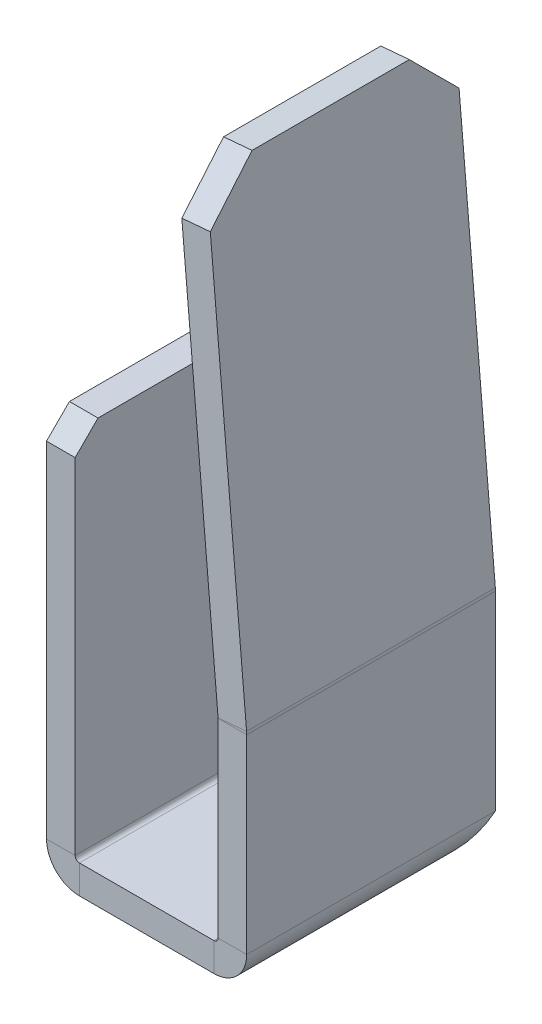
ISO-10303-21;
HEADER;
FILE_DESCRIPTION(('STEP AP214'),'2;1');
FILE_NAME('part.step','',(''),(''),'','','');
FILE_SCHEMA(('AUTOMOTIVE_DESIGN { 1 0 10303 214 1 1 1 1 }'));
ENDSEC;
DATA;
#1=APPLICATION_CONTEXT('core data for automotive mechanical design processes');
#2=APPLICATION_PROTOCOL_DEFINITION('international standard','automotive_design',2000,#1);
#3=PRODUCT_CONTEXT('',#1,'mechanical');
#4=PRODUCT('Part','Part','',(#3));
#5=PRODUCT_RELATED_PRODUCT_CATEGORY('part','',(#4));
#6=PRODUCT_DEFINITION_FORMATION('','',#4);
#7=PRODUCT_DEFINITION_CONTEXT('part definition',#1,'design');
#8=PRODUCT_DEFINITION('design','',#6,#7);
#9=PRODUCT_DEFINITION_SHAPE('','',#8);
#10=(LENGTH_UNIT() NAMED_UNIT(*) SI_UNIT(.MILLI.,.METRE.));
#11=(NAMED_UNIT(*) PLANE_ANGLE_UNIT() SI_UNIT($,.RADIAN.));
#12=(NAMED_UNIT(*) SI_UNIT($,.STERADIAN.) SOLID_ANGLE_UNIT());
#13=UNCERTAINTY_MEASURE_WITH_UNIT(LENGTH_MEASURE(1.E-05),#10,'distance_accuracy_value','');
#14=(GEOMETRIC_REPRESENTATION_CONTEXT(3) GLOBAL_UNCERTAINTY_ASSIGNED_CONTEXT((#13)) GLOBAL_UNIT_ASSIGNED_CONTEXT((#10,
#11,#12)) REPRESENTATION_CONTEXT('',''));
#15=CARTESIAN_POINT('',(0.,0.,0.));
#16=DIRECTION('',(0.,0.,1.));
#17=DIRECTION('',(1.,0.,0.));
#18=AXIS2_PLACEMENT_3D('',#15,#16,#17);
#19=CARTESIAN_POINT('',(35.,-1.56345456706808E-13,0.));
#20=DIRECTION('',(-1.,0.,0.));
#21=DIRECTION('',(0.,-1.,0.));
#22=AXIS2_PLACEMENT_3D('',#19,#20,#21);
#23=PLANE('',#22);
#24=DIRECTION('',(0.,1.,0.));
#25=VECTOR('',#24,1.);
#26=CARTESIAN_POINT('',(35.,-1.56345456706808E-13,-54.5));
#27=LINE('',#26,#25);
#28=CARTESIAN_POINT('',(35.,1.49999999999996,-54.5));
#29=VERTEX_POINT('',#28);
#30=CARTESIAN_POINT('',(35.0000000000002,68.0536504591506,-54.5));
#31=VERTEX_POINT('',#30);
#32=EDGE_CURVE('E389',#29,#31,#27,.T.);
#33=ORIENTED_EDGE('',*,*,#32,.T.);
#34=DIRECTION('',(0.,0.,1.));
#35=VECTOR('',#34,1.);
#36=CARTESIAN_POINT('',(35.0000000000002,68.0536504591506,0.));
#37=LINE('',#36,#35);
#38=CARTESIAN_POINT('',(35.0000000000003,68.0536504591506,32.5));
#39=VERTEX_POINT('',#38);
#40=EDGE_CURVE('E257',#31,#39,#37,.T.);
#41=ORIENTED_EDGE('',*,*,#40,.T.);
#42=DIRECTION('',(0.,-1.,0.));
#43=VECTOR('',#42,1.);
#44=CARTESIAN_POINT('',(35.,-1.56345456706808E-13,32.5));
#45=LINE('',#44,#43);
#46=CARTESIAN_POINT('',(35.,1.49999999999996,32.5));
#47=VERTEX_POINT('',#46);
#48=EDGE_CURVE('E391',#39,#47,#45,.T.);
#49=ORIENTED_EDGE('',*,*,#48,.T.);
#50=DIRECTION('',(0.,0.,-1.));
#51=VECTOR('',#50,1.);
#52=CARTESIAN_POINT('',(35.,1.49999999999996,32.5));
#53=LINE('',#52,#51);
#54=EDGE_CURVE('E270',#29,#47,#53,.F.);
#55=ORIENTED_EDGE('',*,*,#54,.F.);
#56=EDGE_LOOP('',(#33,#41,#49,#55));
#57=FACE_BOUND('',#56,.T.);
#58=ADVANCED_FACE('F84',(#57),#23,.F.);
#59=CARTESIAN_POINT('',(35.0000000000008,230.,-54.5));
#60=DIRECTION('',(0.,0.,1.));
#61=DIRECTION('',(1.,0.,0.));
#62=AXIS2_PLACEMENT_3D('',#59,#60,#61);
#63=PLANE('',#62);
#64=DIRECTION('',(0.,-1.,0.));
#65=VECTOR('',#64,1.);
#66=CARTESIAN_POINT('',(25.0000000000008,230.,-54.5));
#67=LINE('',#66,#65);
#68=CARTESIAN_POINT('',(24.9999999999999,1.49999999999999,-54.5));
#69=VERTEX_POINT('',#68);
#70=CARTESIAN_POINT('',(25.0000000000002,68.0536504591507,-54.5));
#71=VERTEX_POINT('',#70);
#72=EDGE_CURVE('E393',#69,#71,#67,.F.);
#73=ORIENTED_EDGE('',*,*,#72,.T.);
#74=DIRECTION('',(1.,0.,0.));
#75=VECTOR('',#74,1.);
#76=CARTESIAN_POINT('',(35.0000000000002,68.0536504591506,-54.5));
#77=LINE('',#76,#75);
#78=EDGE_CURVE('E401',#71,#31,#77,.T.);
#79=ORIENTED_EDGE('',*,*,#78,.T.);
#80=ORIENTED_EDGE('',*,*,#32,.F.);
#81=DIRECTION('',(-1.,0.,0.));
#82=VECTOR('',#81,1.);
#83=CARTESIAN_POINT('',(25.,1.49999999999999,-54.5));
#84=LINE('',#83,#82);
#85=EDGE_CURVE('E274',#69,#29,#84,.F.);
#86=ORIENTED_EDGE('',*,*,#85,.F.);
#87=EDGE_LOOP('',(#73,#79,#80,#86));
#88=FACE_BOUND('',#87,.T.);
#89=ADVANCED_FACE('F344',(#88),#63,.F.);
#90=CARTESIAN_POINT('',(35.,0.,32.5));
#91=DIRECTION('',(0.,0.,-1.));
#92=DIRECTION('',(-1.,0.,0.));
#93=AXIS2_PLACEMENT_3D('',#90,#91,#92);
#94=PLANE('',#93);
#95=ORIENTED_EDGE('',*,*,#48,.F.);
#96=DIRECTION('',(-1.,0.,0.));
#97=VECTOR('',#96,1.);
#98=CARTESIAN_POINT('',(35.0000000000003,68.0536504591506,32.5));
#99=LINE('',#98,#97);
#100=CARTESIAN_POINT('',(25.0000000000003,68.0536504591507,32.5));
#101=VERTEX_POINT('',#100);
#102=EDGE_CURVE('E388',#39,#101,#99,.T.);
#103=ORIENTED_EDGE('',*,*,#102,.T.);
#104=DIRECTION('',(0.,1.,0.));
#105=VECTOR('',#104,1.);
#106=CARTESIAN_POINT('',(25.,0.,32.5));
#107=LINE('',#106,#105);
#108=CARTESIAN_POINT('',(25.,1.49999999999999,32.5));
#109=VERTEX_POINT('',#108);
#110=EDGE_CURVE('E273',#101,#109,#107,.F.);
#111=ORIENTED_EDGE('',*,*,#110,.T.);
#112=DIRECTION('',(-1.,0.,0.));
#113=VECTOR('',#112,1.);
#114=CARTESIAN_POINT('',(35.,1.49999999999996,32.5));
#115=LINE('',#114,#113);
#116=EDGE_CURVE('E262',#109,#47,#115,.F.);
#117=ORIENTED_EDGE('',*,*,#116,.T.);
#118=EDGE_LOOP('',(#95,#103,#111,#117));
#119=FACE_BOUND('',#118,.T.);
#120=ADVANCED_FACE('F350',(#119),#94,.F.);
#121=CARTESIAN_POINT('',(0.,-10.,0.));
#122=DIRECTION('',(0.,1.,0.));
#123=DIRECTION('',(0.,0.,1.));
#124=AXIS2_PLACEMENT_3D('',#121,#122,#123);
#125=PLANE('',#124);
#126=DIRECTION('',(0.,0.,-1.));
#127=VECTOR('',#126,1.);
#128=CARTESIAN_POINT('',(23.5000000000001,-9.99999999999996,-54.5));
#129=LINE('',#128,#127);
#130=CARTESIAN_POINT('',(23.5000000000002,-9.99999999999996,-32.5));
#131=VERTEX_POINT('',#130);
#132=CARTESIAN_POINT('',(23.5000000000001,-10.,32.5));
#133=VERTEX_POINT('',#132);
#134=EDGE_CURVE('E285',#131,#133,#129,.F.);
#135=ORIENTED_EDGE('',*,*,#134,.T.);
#136=DIRECTION('',(1.,0.,0.));
#137=VECTOR('',#136,1.);
#138=CARTESIAN_POINT('',(-35.,-10.,32.5));
#139=LINE('',#138,#137);
#140=CARTESIAN_POINT('',(-23.5,-10.,32.5));
#141=VERTEX_POINT('',#140);
#142=EDGE_CURVE('E460',#141,#133,#139,.T.);
#143=ORIENTED_EDGE('',*,*,#142,.F.);
#144=DIRECTION('',(0.,0.,1.));
#145=VECTOR('',#144,1.);
#146=CARTESIAN_POINT('',(-23.5,-10.,32.5));
#147=LINE('',#146,#145);
#148=CARTESIAN_POINT('',(-23.5,-10.,-32.5));
#149=VERTEX_POINT('',#148);
#150=EDGE_CURVE('E298',#141,#149,#147,.F.);
#151=ORIENTED_EDGE('',*,*,#150,.T.);
#152=DIRECTION('',(-1.,0.,0.));
#153=VECTOR('',#152,1.);
#154=CARTESIAN_POINT('',(-35.,-10.,-32.5));
#155=LINE('',#154,#153);
#156=EDGE_CURVE('E464',#131,#149,#155,.T.);
#157=ORIENTED_EDGE('',*,*,#156,.F.);
#158=EDGE_LOOP('',(#135,#143,#151,#157));
#159=FACE_BOUND('',#158,.T.);
#160=ADVANCED_FACE('F354',(#159),#125,.F.);
#161=CARTESIAN_POINT('',(0.,0.,0.));
#162=DIRECTION('',(0.,1.,0.));
#163=DIRECTION('',(0.,0.,1.));
#164=AXIS2_PLACEMENT_3D('',#161,#162,#163);
#165=PLANE('',#164);
#166=DIRECTION('',(1.,0.,0.));
#167=VECTOR('',#166,1.);
#168=CARTESIAN_POINT('',(-35.,0.,32.5));
#169=LINE('',#168,#167);
#170=CARTESIAN_POINT('',(-23.5,0.,32.5));
#171=VERTEX_POINT('',#170);
#172=CARTESIAN_POINT('',(23.5000000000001,0.,32.5));
#173=VERTEX_POINT('',#172);
#174=EDGE_CURVE('E446',#171,#173,#169,.T.);
#175=ORIENTED_EDGE('',*,*,#174,.T.);
#176=DIRECTION('',(0.,0.,-1.));
#177=VECTOR('',#176,1.);
#178=CARTESIAN_POINT('',(23.5,0.,-54.5));
#179=LINE('',#178,#177);
#180=CARTESIAN_POINT('',(23.5,0.,-32.5));
#181=VERTEX_POINT('',#180);
#182=EDGE_CURVE('E290',#181,#173,#179,.F.);
#183=ORIENTED_EDGE('',*,*,#182,.F.);
#184=DIRECTION('',(-1.,0.,0.));
#185=VECTOR('',#184,1.);
#186=CARTESIAN_POINT('',(-35.,0.,-32.5));
#187=LINE('',#186,#185);
#188=CARTESIAN_POINT('',(-23.5,0.,-32.5));
#189=VERTEX_POINT('',#188);
#190=EDGE_CURVE('E466',#181,#189,#187,.T.);
#191=ORIENTED_EDGE('',*,*,#190,.T.);
#192=DIRECTION('',(0.,0.,1.));
#193=VECTOR('',#192,1.);
#194=CARTESIAN_POINT('',(-23.5,0.,32.5));
#195=LINE('',#194,#193);
#196=EDGE_CURVE('E433',#171,#189,#195,.F.);
#197=ORIENTED_EDGE('',*,*,#196,.F.);
#198=EDGE_LOOP('',(#175,#183,#191,#197));
#199=FACE_BOUND('',#198,.T.);
#200=ADVANCED_FACE('F529',(#199),#165,.T.);
#201=CARTESIAN_POINT('',(-35.,-10.,-32.5));
#202=DIRECTION('',(0.,0.,-1.));
#203=DIRECTION('',(-1.,0.,0.));
#204=AXIS2_PLACEMENT_3D('',#201,#202,#203);
#205=PLANE('',#204);
#206=DIRECTION('',(0.,-1.,0.));
#207=VECTOR('',#206,1.);
#208=CARTESIAN_POINT('',(-23.5,0.,-32.5));
#209=LINE('',#208,#207);
#210=EDGE_CURVE('E449',#189,#149,#209,.T.);
#211=ORIENTED_EDGE('',*,*,#210,.F.);
#212=ORIENTED_EDGE('',*,*,#190,.F.);
#213=DIRECTION('',(0.,-1.,0.));
#214=VECTOR('',#213,1.);
#215=CARTESIAN_POINT('',(23.5,0.,-32.5));
#216=LINE('',#215,#214);
#217=EDGE_CURVE('E284',#181,#131,#216,.T.);
#218=ORIENTED_EDGE('',*,*,#217,.T.);
#219=ORIENTED_EDGE('',*,*,#156,.T.);
#220=EDGE_LOOP('',(#211,#212,#218,#219));
#221=FACE_BOUND('',#220,.T.);
#222=ADVANCED_FACE('F522',(#221),#205,.T.);
#223=CARTESIAN_POINT('',(-35.,-10.,32.5));
#224=DIRECTION('',(0.,0.,1.));
#225=DIRECTION('',(1.,0.,0.));
#226=AXIS2_PLACEMENT_3D('',#223,#224,#225);
#227=PLANE('',#226);
#228=DIRECTION('',(0.,-1.,0.));
#229=VECTOR('',#228,1.);
#230=CARTESIAN_POINT('',(23.5000000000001,0.,32.5));
#231=LINE('',#230,#229);
#232=EDGE_CURVE('E295',#173,#133,#231,.T.);
#233=ORIENTED_EDGE('',*,*,#232,.F.);
#234=ORIENTED_EDGE('',*,*,#174,.F.);
#235=DIRECTION('',(0.,-1.,0.));
#236=VECTOR('',#235,1.);
#237=CARTESIAN_POINT('',(-23.5,0.,32.5));
#238=LINE('',#237,#236);
#239=EDGE_CURVE('E461',#171,#141,#238,.T.);
#240=ORIENTED_EDGE('',*,*,#239,.T.);
#241=ORIENTED_EDGE('',*,*,#142,.T.);
#242=EDGE_LOOP('',(#233,#234,#240,#241));
#243=FACE_BOUND('',#242,.T.);
#244=ADVANCED_FACE('F531',(#243),#227,.T.);
#245=CARTESIAN_POINT('',(-23.5,1.5,-32.5));
#246=DIRECTION('',(0.,0.,-1.));
#247=DIRECTION('',(0.,1.,0.));
#248=AXIS2_PLACEMENT_3D('',#245,#246,#247);
#249=PLANE('',#248);
#250=DIRECTION('',(1.,0.,0.));
#251=VECTOR('',#250,1.);
#252=CARTESIAN_POINT('',(-35.,1.49999999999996,-32.5));
#253=LINE('',#252,#251);
#254=CARTESIAN_POINT('',(-25.,1.5,-32.5));
#255=VERTEX_POINT('',#254);
#256=CARTESIAN_POINT('',(-35.,1.49999999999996,-32.5));
#257=VERTEX_POINT('',#256);
#258=EDGE_CURVE('E413',#255,#257,#253,.F.);
#259=ORIENTED_EDGE('',*,*,#258,.F.);
#260=CARTESIAN_POINT('',(-23.5,1.5,-32.5));
#261=DIRECTION('',(0.,0.,1.));
#262=DIRECTION('',(0.,-1.,0.));
#263=AXIS2_PLACEMENT_3D('',#260,#261,#262);
#264=CIRCLE('',#263,1.5);
#265=EDGE_CURVE('E441',#189,#255,#264,.F.);
#266=ORIENTED_EDGE('',*,*,#265,.F.);
#267=ORIENTED_EDGE('',*,*,#210,.T.);
#268=CARTESIAN_POINT('',(-23.5,1.5,-32.5));
#269=DIRECTION('',(0.,0.,1.));
#270=DIRECTION('',(0.,-1.,0.));
#271=AXIS2_PLACEMENT_3D('',#268,#269,#270);
#272=CIRCLE('',#271,11.5);
#273=EDGE_CURVE('E438',#149,#257,#272,.F.);
#274=ORIENTED_EDGE('',*,*,#273,.T.);
#275=EDGE_LOOP('',(#259,#266,#267,#274));
#276=FACE_BOUND('',#275,.T.);
#277=ADVANCED_FACE('F517',(#276),#249,.T.);
#278=CARTESIAN_POINT('',(-23.5,1.49999999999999,32.5));
#279=DIRECTION('',(0.,0.,-1.));
#280=DIRECTION('',(0.,1.,0.));
#281=AXIS2_PLACEMENT_3D('',#278,#279,#280);
#282=PLANE('',#281);
#283=CARTESIAN_POINT('',(-23.5,1.49999999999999,32.5));
#284=DIRECTION('',(0.,0.,1.));
#285=DIRECTION('',(0.,-1.,0.));
#286=AXIS2_PLACEMENT_3D('',#283,#284,#285);
#287=CIRCLE('',#286,1.5);
#288=CARTESIAN_POINT('',(-25.,1.49999999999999,32.5));
#289=VERTEX_POINT('',#288);
#290=EDGE_CURVE('E429',#289,#171,#287,.T.);
#291=ORIENTED_EDGE('',*,*,#290,.F.);
#292=DIRECTION('',(1.,0.,0.));
#293=VECTOR('',#292,1.);
#294=CARTESIAN_POINT('',(-25.,1.49999999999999,32.5));
#295=LINE('',#294,#293);
#296=CARTESIAN_POINT('',(-35.,1.49999999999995,32.5));
#297=VERTEX_POINT('',#296);
#298=EDGE_CURVE('E435',#289,#297,#295,.F.);
#299=ORIENTED_EDGE('',*,*,#298,.T.);
#300=CARTESIAN_POINT('',(-23.5,1.49999999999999,32.5));
#301=DIRECTION('',(0.,0.,1.));
#302=DIRECTION('',(0.,-1.,0.));
#303=AXIS2_PLACEMENT_3D('',#300,#301,#302);
#304=CIRCLE('',#303,11.5);
#305=EDGE_CURVE('E434',#297,#141,#304,.T.);
#306=ORIENTED_EDGE('',*,*,#305,.T.);
#307=ORIENTED_EDGE('',*,*,#239,.F.);
#308=EDGE_LOOP('',(#291,#299,#306,#307));
#309=FACE_BOUND('',#308,.T.);
#310=ADVANCED_FACE('F510',(#309),#282,.F.);
#311=CARTESIAN_POINT('',(-23.5,1.49999999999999,32.5));
#312=DIRECTION('',(0.,0.,1.));
#313=DIRECTION('',(-1.,0.,0.));
#314=AXIS2_PLACEMENT_3D('',#311,#312,#313);
#315=CYLINDRICAL_SURFACE('',#314,11.5);
#316=ORIENTED_EDGE('',*,*,#150,.F.);
#317=ORIENTED_EDGE('',*,*,#305,.F.);
#318=DIRECTION('',(0.,0.,1.));
#319=VECTOR('',#318,1.);
#320=CARTESIAN_POINT('',(-35.,1.49999999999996,-32.5));
#321=LINE('',#320,#319);
#322=EDGE_CURVE('E430',#297,#257,#321,.F.);
#323=ORIENTED_EDGE('',*,*,#322,.T.);
#324=ORIENTED_EDGE('',*,*,#273,.F.);
#325=EDGE_LOOP('',(#316,#317,#323,#324));
#326=FACE_BOUND('',#325,.T.);
#327=ADVANCED_FACE('F515',(#326),#315,.T.);
#328=CARTESIAN_POINT('',(-23.5,1.49999999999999,32.5));
#329=DIRECTION('',(0.,0.,1.));
#330=DIRECTION('',(-1.,0.,0.));
#331=AXIS2_PLACEMENT_3D('',#328,#329,#330);
#332=CYLINDRICAL_SURFACE('',#331,1.5);
#333=ORIENTED_EDGE('',*,*,#196,.T.);
#334=ORIENTED_EDGE('',*,*,#265,.T.);
#335=DIRECTION('',(0.,0.,1.));
#336=VECTOR('',#335,1.);
#337=CARTESIAN_POINT('',(-25.,1.49999999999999,-32.5));
#338=LINE('',#337,#336);
#339=EDGE_CURVE('E439',#255,#289,#338,.T.);
#340=ORIENTED_EDGE('',*,*,#339,.T.);
#341=ORIENTED_EDGE('',*,*,#290,.T.);
#342=EDGE_LOOP('',(#333,#334,#340,#341));
#343=FACE_BOUND('',#342,.T.);
#344=ADVANCED_FACE('F526',(#343),#332,.F.);
#345=CARTESIAN_POINT('',(-35.0000000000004,130.,32.5));
#346=DIRECTION('',(0.,0.,-1.));
#347=DIRECTION('',(-1.,0.,0.));
#348=AXIS2_PLACEMENT_3D('',#345,#346,#347);
#349=PLANE('',#348);
#350=DIRECTION('',(0.,-1.,0.));
#351=VECTOR('',#350,1.);
#352=CARTESIAN_POINT('',(-25.0000000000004,130.,32.5));
#353=LINE('',#352,#351);
#354=CARTESIAN_POINT('',(-25.0000000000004,122.,32.5));
#355=VERTEX_POINT('',#354);
#356=EDGE_CURVE('E425',#289,#355,#353,.F.);
#357=ORIENTED_EDGE('',*,*,#356,.T.);
#358=DIRECTION('',(-1.,0.,0.));
#359=VECTOR('',#358,1.);
#360=CARTESIAN_POINT('',(-35.0000000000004,122.,32.5));
#361=LINE('',#360,#359);
#362=CARTESIAN_POINT('',(-35.0000000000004,122.,32.5));
#363=VERTEX_POINT('',#362);
#364=EDGE_CURVE('E428',#355,#363,#361,.T.);
#365=ORIENTED_EDGE('',*,*,#364,.T.);
#366=DIRECTION('',(0.,1.,0.));
#367=VECTOR('',#366,1.);
#368=CARTESIAN_POINT('',(-35.,-1.56345456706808E-13,32.5));
#369=LINE('',#368,#367);
#370=EDGE_CURVE('E408',#297,#363,#369,.T.);
#371=ORIENTED_EDGE('',*,*,#370,.F.);
#372=ORIENTED_EDGE('',*,*,#298,.F.);
#373=EDGE_LOOP('',(#357,#365,#371,#372));
#374=FACE_BOUND('',#373,.T.);
#375=ADVANCED_FACE('F506',(#374),#349,.F.);
#376=CARTESIAN_POINT('',(-35.,0.,-32.5));
#377=DIRECTION('',(0.,0.,1.));
#378=DIRECTION('',(1.,0.,0.));
#379=AXIS2_PLACEMENT_3D('',#376,#377,#378);
#380=PLANE('',#379);
#381=DIRECTION('',(0.,-1.,0.));
#382=VECTOR('',#381,1.);
#383=CARTESIAN_POINT('',(-35.,-1.56345456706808E-13,-32.5));
#384=LINE('',#383,#382);
#385=CARTESIAN_POINT('',(-35.0000000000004,122.,-32.5));
#386=VERTEX_POINT('',#385);
#387=EDGE_CURVE('E406',#386,#257,#384,.T.);
#388=ORIENTED_EDGE('',*,*,#387,.F.);
#389=DIRECTION('',(1.,0.,0.));
#390=VECTOR('',#389,1.);
#391=CARTESIAN_POINT('',(-35.0000000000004,122.,-32.5));
#392=LINE('',#391,#390);
#393=CARTESIAN_POINT('',(-25.0000000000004,122.,-32.5));
#394=VERTEX_POINT('',#393);
#395=EDGE_CURVE('E419',#386,#394,#392,.T.);
#396=ORIENTED_EDGE('',*,*,#395,.T.);
#397=DIRECTION('',(0.,1.,0.));
#398=VECTOR('',#397,1.);
#399=CARTESIAN_POINT('',(-25.,0.,-32.5));
#400=LINE('',#399,#398);
#401=EDGE_CURVE('E417',#394,#255,#400,.F.);
#402=ORIENTED_EDGE('',*,*,#401,.T.);
#403=ORIENTED_EDGE('',*,*,#258,.T.);
#404=EDGE_LOOP('',(#388,#396,#402,#403));
#405=FACE_BOUND('',#404,.T.);
#406=ADVANCED_FACE('F490',(#405),#380,.F.);
#407=CARTESIAN_POINT('',(-35.,-1.56345456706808E-13,0.));
#408=DIRECTION('',(1.,0.,0.));
#409=DIRECTION('',(0.,1.,0.));
#410=AXIS2_PLACEMENT_3D('',#407,#408,#409);
#411=PLANE('',#410);
#412=DIRECTION('',(0.,0.,-1.));
#413=VECTOR('',#412,1.);
#414=CARTESIAN_POINT('',(-35.0000000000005,130.,0.));
#415=LINE('',#414,#413);
#416=CARTESIAN_POINT('',(-35.0000000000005,130.,24.5));
#417=VERTEX_POINT('',#416);
#418=CARTESIAN_POINT('',(-35.0000000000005,130.,-24.5));
#419=VERTEX_POINT('',#418);
#420=EDGE_CURVE('E410',#417,#419,#415,.T.);
#421=ORIENTED_EDGE('',*,*,#420,.T.);
#422=DIRECTION('',(0.,0.707106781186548,0.707106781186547));
#423=VECTOR('',#422,1.);
#424=CARTESIAN_POINT('',(-35.0000000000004,122.,-32.5));
#425=LINE('',#424,#423);
#426=EDGE_CURVE('E409',#419,#386,#425,.F.);
#427=ORIENTED_EDGE('',*,*,#426,.T.);
#428=ORIENTED_EDGE('',*,*,#387,.T.);
#429=ORIENTED_EDGE('',*,*,#322,.F.);
#430=ORIENTED_EDGE('',*,*,#370,.T.);
#431=DIRECTION('',(0.,-0.707106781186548,0.707106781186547));
#432=VECTOR('',#431,1.);
#433=CARTESIAN_POINT('',(-35.0000000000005,130.,24.5));
#434=LINE('',#433,#432);
#435=EDGE_CURVE('E416',#363,#417,#434,.F.);
#436=ORIENTED_EDGE('',*,*,#435,.T.);
#437=EDGE_LOOP('',(#421,#427,#428,#429,#430,#436));
#438=FACE_BOUND('',#437,.T.);
#439=ADVANCED_FACE('F484',(#438),#411,.F.);
#440=CARTESIAN_POINT('',(-25.,-1.21430643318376E-13,0.));
#441=DIRECTION('',(1.,0.,0.));
#442=DIRECTION('',(0.,1.,0.));
#443=AXIS2_PLACEMENT_3D('',#440,#441,#442);
#444=PLANE('',#443);
#445=ORIENTED_EDGE('',*,*,#401,.F.);
#446=DIRECTION('',(0.,-0.707106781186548,-0.707106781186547));
#447=VECTOR('',#446,1.);
#448=CARTESIAN_POINT('',(-25.0000000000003,77.2499999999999,-77.2500000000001));
#449=LINE('',#448,#447);
#450=CARTESIAN_POINT('',(-25.0000000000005,130.,-24.5));
#451=VERTEX_POINT('',#450);
#452=EDGE_CURVE('E475',#394,#451,#449,.F.);
#453=ORIENTED_EDGE('',*,*,#452,.T.);
#454=DIRECTION('',(0.,0.,1.));
#455=VECTOR('',#454,1.);
#456=CARTESIAN_POINT('',(-25.0000000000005,130.,-32.5));
#457=LINE('',#456,#455);
#458=CARTESIAN_POINT('',(-25.0000000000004,130.,24.5));
#459=VERTEX_POINT('',#458);
#460=EDGE_CURVE('E420',#459,#451,#457,.F.);
#461=ORIENTED_EDGE('',*,*,#460,.F.);
#462=DIRECTION('',(0.,0.707106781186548,-0.707106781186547));
#463=VECTOR('',#462,1.);
#464=CARTESIAN_POINT('',(-25.0000000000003,77.2499999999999,77.2500000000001));
#465=LINE('',#464,#463);
#466=EDGE_CURVE('E424',#459,#355,#465,.F.);
#467=ORIENTED_EDGE('',*,*,#466,.T.);
#468=ORIENTED_EDGE('',*,*,#356,.F.);
#469=ORIENTED_EDGE('',*,*,#339,.F.);
#470=EDGE_LOOP('',(#445,#453,#461,#467,#468,#469));
#471=FACE_BOUND('',#470,.T.);
#472=ADVANCED_FACE('F495',(#471),#444,.T.);
#473=CARTESIAN_POINT('',(-35.0000000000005,130.,-32.5));
#474=DIRECTION('',(0.,-1.,0.));
#475=DIRECTION('',(1.,0.,0.));
#476=AXIS2_PLACEMENT_3D('',#473,#474,#475);
#477=PLANE('',#476);
#478=ORIENTED_EDGE('',*,*,#460,.T.);
#479=DIRECTION('',(-1.,0.,0.));
#480=VECTOR('',#479,1.);
#481=CARTESIAN_POINT('',(-35.0000000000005,130.,-24.5));
#482=LINE('',#481,#480);
#483=EDGE_CURVE('E423',#451,#419,#482,.T.);
#484=ORIENTED_EDGE('',*,*,#483,.T.);
#485=ORIENTED_EDGE('',*,*,#420,.F.);
#486=DIRECTION('',(1.,0.,0.));
#487=VECTOR('',#486,1.);
#488=CARTESIAN_POINT('',(-35.0000000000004,130.,24.5));
#489=LINE('',#488,#487);
#490=EDGE_CURVE('E405',#417,#459,#489,.T.);
#491=ORIENTED_EDGE('',*,*,#490,.T.);
#492=EDGE_LOOP('',(#478,#484,#485,#491));
#493=FACE_BOUND('',#492,.T.);
#494=ADVANCED_FACE('F498',(#493),#477,.F.);
#495=CARTESIAN_POINT('',(-35.0000000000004,130.,24.5));
#496=DIRECTION('',(0.,-0.707106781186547,-0.707106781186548));
#497=DIRECTION('',(1.,0.,0.));
#498=AXIS2_PLACEMENT_3D('',#495,#496,#497);
#499=PLANE('',#498);
#500=ORIENTED_EDGE('',*,*,#435,.F.);
#501=ORIENTED_EDGE('',*,*,#364,.F.);
#502=ORIENTED_EDGE('',*,*,#466,.F.);
#503=ORIENTED_EDGE('',*,*,#490,.F.);
#504=EDGE_LOOP('',(#500,#501,#502,#503));
#505=FACE_BOUND('',#504,.T.);
#506=ADVANCED_FACE('F340',(#505),#499,.F.);
#507=CARTESIAN_POINT('',(-35.0000000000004,122.,-32.5));
#508=DIRECTION('',(0.,-0.707106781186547,0.707106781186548));
#509=DIRECTION('',(1.,0.,0.));
#510=AXIS2_PLACEMENT_3D('',#507,#508,#509);
#511=PLANE('',#510);
#512=ORIENTED_EDGE('',*,*,#426,.F.);
#513=ORIENTED_EDGE('',*,*,#483,.F.);
#514=ORIENTED_EDGE('',*,*,#452,.F.);
#515=ORIENTED_EDGE('',*,*,#395,.F.);
#516=EDGE_LOOP('',(#512,#513,#514,#515));
#517=FACE_BOUND('',#516,.T.);
#518=ADVANCED_FACE('F333',(#517),#511,.F.);
#519=CARTESIAN_POINT('',(23.5000000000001,1.5,32.5));
#520=DIRECTION('',(0.,0.,1.));
#521=DIRECTION('',(1.,0.,0.));
#522=AXIS2_PLACEMENT_3D('',#519,#520,#521);
#523=PLANE('',#522);
#524=ORIENTED_EDGE('',*,*,#116,.F.);
#525=CARTESIAN_POINT('',(23.5000000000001,1.5,32.5));
#526=DIRECTION('',(0.,0.,-1.));
#527=DIRECTION('',(-1.,0.,0.));
#528=AXIS2_PLACEMENT_3D('',#525,#526,#527);
#529=CIRCLE('',#528,1.49999999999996);
#530=EDGE_CURVE('E286',#173,#109,#529,.F.);
#531=ORIENTED_EDGE('',*,*,#530,.F.);
#532=ORIENTED_EDGE('',*,*,#232,.T.);
#533=CARTESIAN_POINT('',(23.5000000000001,1.5,32.5));
#534=DIRECTION('',(0.,0.,-1.));
#535=DIRECTION('',(-1.,0.,0.));
#536=AXIS2_PLACEMENT_3D('',#533,#534,#535);
#537=CIRCLE('',#536,11.5);
#538=EDGE_CURVE('E281',#133,#47,#537,.F.);
#539=ORIENTED_EDGE('',*,*,#538,.T.);
#540=EDGE_LOOP('',(#524,#531,#532,#539));
#541=FACE_BOUND('',#540,.T.);
#542=ADVANCED_FACE('F331',(#541),#523,.T.);
#543=CARTESIAN_POINT('',(35.0999999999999,1.49999999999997,-54.5));
#544=CARTESIAN_POINT('',(35.0999999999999,-0.0185468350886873,-52.6665322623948));
#545=CARTESIAN_POINT('',(34.7980830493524,-1.53627545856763,-50.8333333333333));
#546=CARTESIAN_POINT('',(33.6359221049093,-4.34198017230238,-47.1666666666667));
#547=CARTESIAN_POINT('',(32.7761353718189,-5.62874195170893,-45.3333333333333));
#548=CARTESIAN_POINT('',(30.628741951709,-7.7761353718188,-41.6666666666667));
#549=CARTESIAN_POINT('',(29.3419801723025,-8.63592210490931,-39.8333333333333));
#550=CARTESIAN_POINT('',(26.5362754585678,-9.79808304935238,-36.1666666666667));
#551=CARTESIAN_POINT('',(25.0185468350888,-10.0999999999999,-34.3334677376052));
#552=CARTESIAN_POINT('',(23.5000000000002,-10.1,-32.5));
#553=CARTESIAN_POINT('',(34.9999999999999,1.49999999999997,-54.5));
#554=CARTESIAN_POINT('',(34.9999999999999,-0.00545577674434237,-52.6665335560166));
#555=CARTESIAN_POINT('',(34.7006857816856,-1.51010067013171,-50.8333333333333));
#556=CARTESIAN_POINT('',(33.5485434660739,-4.29161827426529,-47.1666666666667));
#557=CARTESIAN_POINT('',(32.696168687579,-5.56728727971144,-45.3333333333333));
#558=CARTESIAN_POINT('',(30.5672872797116,-7.69616868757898,-41.6666666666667));
#559=CARTESIAN_POINT('',(29.2916182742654,-8.54854346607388,-39.8333333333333));
#560=CARTESIAN_POINT('',(26.5101006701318,-9.70068578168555,-36.1666666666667));
#561=CARTESIAN_POINT('',(25.0054557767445,-9.99999999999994,-34.3334664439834));
#562=CARTESIAN_POINT('',(23.5000000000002,-9.99999999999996,-32.5));
#563=CARTESIAN_POINT('',(24.9999999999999,1.5,-54.5));
#564=CARTESIAN_POINT('',(24.9999999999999,1.30365005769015,-52.6666629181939));
#565=CARTESIAN_POINT('',(24.9609590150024,1.10737817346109,-50.8333333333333));
#566=CARTESIAN_POINT('',(24.8106795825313,0.744571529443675,-47.1666666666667));
#567=CARTESIAN_POINT('',(24.6995002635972,0.578179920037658,-45.3333333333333));
#568=CARTESIAN_POINT('',(24.4218200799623,0.300499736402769,-41.6666666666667));
#569=CARTESIAN_POINT('',(24.2554284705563,0.189320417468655,-39.8333333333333));
#570=CARTESIAN_POINT('',(23.8926218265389,0.0390409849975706,-36.1666666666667));
#571=CARTESIAN_POINT('',(23.6963499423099,0.,-34.3333370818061));
#572=CARTESIAN_POINT('',(23.5,0.,-32.5));
#573=CARTESIAN_POINT('',(24.8989999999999,1.5,-54.5));
#574=CARTESIAN_POINT('',(24.8989999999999,1.31687202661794,-52.6666642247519));
#575=CARTESIAN_POINT('',(24.8625877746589,1.13381470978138,-50.8333333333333));
#576=CARTESIAN_POINT('',(24.7224271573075,0.795437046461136,-47.1666666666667));
#577=CARTESIAN_POINT('',(24.618733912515,0.640249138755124,-45.3333333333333));
#578=CARTESIAN_POINT('',(24.3597508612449,0.381266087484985,-41.6666666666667));
#579=CARTESIAN_POINT('',(24.2045629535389,0.277572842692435,-39.8333333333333));
#580=CARTESIAN_POINT('',(23.8661852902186,0.13741222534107,-36.1666666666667));
#581=CARTESIAN_POINT('',(23.6831279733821,0.101000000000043,-34.3333357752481));
#582=CARTESIAN_POINT('',(23.5,0.10100000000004,-32.5));
#583=B_SPLINE_SURFACE_WITH_KNOTS('',1,3,((#543,#544,#545,#546,#547,#548,#549,#550,#551,#552),
(#553,#554,#555,#556,#557,#558,#559,#560,#561,#562),(#563,#564,#565,#566,#567,#568,#569,#570,
#571,#572),(#573,#574,#575,#576,#577,#578,#579,#580,#581,#582)),.UNSPECIFIED.,.F.,.F.,.F.,(2,1,
1,2),(4,2,2,2,4),(-0.01,0.,1.,1.0101),(0.,0.25,0.5,0.75,1.),.UNSPECIFIED.);
#584=CARTESIAN_POINT('',(24.9999999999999,1.5,-54.5));
#585=CARTESIAN_POINT('',(25.0000090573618,1.44675543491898,-54.0028051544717));
#586=CARTESIAN_POINT('',(24.9971640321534,1.39350728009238,-53.5056152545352));
#587=CARTESIAN_POINT('',(24.9858399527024,1.28760837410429,-52.5112197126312));
#588=CARTESIAN_POINT('',(24.9773607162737,1.23495764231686,-52.0140140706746));
#589=CARTESIAN_POINT('',(24.9435783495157,1.07879137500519,-50.5221699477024));
#590=CARTESIAN_POINT('',(24.9099306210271,0.977085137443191,-49.5275176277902));
#591=CARTESIAN_POINT('',(24.8218830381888,0.783078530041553,-47.5382088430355));
#592=CARTESIAN_POINT('',(24.7674828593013,0.690778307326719,-46.5435523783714));
#593=CARTESIAN_POINT('',(24.634555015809,0.511915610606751,-44.462762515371));
#594=CARTESIAN_POINT('',(24.5542686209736,0.42666134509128,-43.3766284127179));
#595=CARTESIAN_POINT('',(24.376184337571,0.276960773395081,-41.2043412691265));
#596=CARTESIAN_POINT('',(24.278386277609,0.212514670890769,-40.1181882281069));
#597=CARTESIAN_POINT('',(24.1224223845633,0.133982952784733,-38.487723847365));
#598=CARTESIAN_POINT('',(24.068822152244,0.110812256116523,-37.9433956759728));
#599=CARTESIAN_POINT('',(23.9592896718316,0.0708573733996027,-36.8547360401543));
#600=CARTESIAN_POINT('',(23.9033574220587,0.0540731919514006,-36.310404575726));
#601=CARTESIAN_POINT('',(23.7899138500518,0.0271299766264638,-35.2217284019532));
#602=CARTESIAN_POINT('',(23.7324024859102,0.0169711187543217,-34.677383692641));
#603=CARTESIAN_POINT('',(23.6165932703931,0.00339770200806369,-33.5886929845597));
#604=CARTESIAN_POINT('',(23.5582954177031,-1.68455924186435E-05,-33.0443469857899));
#605=CARTESIAN_POINT('',(23.5,0.,-32.5));
#606=B_SPLINE_CURVE_WITH_KNOTS('',3,(#584,#585,#586,#587,#588,#589,#590,#591,#592,#593,#594,
#595,#596,#597,#598,#599,#600,#601,#602,#603,#604,#605),.UNSPECIFIED.,.F.,.F.,(4,2,2,2,2,2,2,2,
2,2,4),(0.,1.50009605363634,3.00024061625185,6.0011734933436,9.00215330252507,12.2791052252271,
15.5560892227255,17.1984085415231,18.8407290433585,20.4830931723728,22.1254600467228),.UNSPECIFIED.);
#607=EDGE_CURVE('E294',#69,#181,#606,.T.);
#608=CARTESIAN_POINT('',(34.9999999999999,1.49999999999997,-54.5));
#609=CARTESIAN_POINT('',(35.0000131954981,1.24447999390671,-54.1887993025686));
#610=CARTESIAN_POINT('',(34.9914843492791,0.988962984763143,-53.8775973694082));
#611=CARTESIAN_POINT('',(34.9574399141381,0.479085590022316,-53.255228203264));
#612=CARTESIAN_POINT('',(34.9319260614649,0.224725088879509,-52.9440609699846));
#613=CARTESIAN_POINT('',(34.8640109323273,-0.281726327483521,-52.3217532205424));
#614=CARTESIAN_POINT('',(34.8216106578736,-0.533817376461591,-52.0106127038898));
#615=CARTESIAN_POINT('',(34.7201164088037,-1.03461133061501,-51.3883366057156));
#616=CARTESIAN_POINT('',(34.6610227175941,-1.28331429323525,-51.0772010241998));
#617=CARTESIAN_POINT('',(34.5266394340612,-1.77536947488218,-50.4559968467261));
#618=CARTESIAN_POINT('',(34.45140655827,-2.01873722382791,-50.1459282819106));
#619=CARTESIAN_POINT('',(34.2849576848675,-2.49993749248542,-49.5257988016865));
#620=CARTESIAN_POINT('',(34.1937420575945,-2.73777014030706,-49.215737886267));
#621=CARTESIAN_POINT('',(33.9957300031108,-3.20685247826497,-48.5956171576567));
#622=CARTESIAN_POINT('',(33.8889338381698,-3.43810227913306,-48.2855573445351));
#623=CARTESIAN_POINT('',(33.6602333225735,-3.89300264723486,-47.6654526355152));
#624=CARTESIAN_POINT('',(33.5383291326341,-4.11665329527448,-47.3554077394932));
#625=CARTESIAN_POINT('',(33.2359376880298,-4.63008520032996,-46.629735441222));
#626=CARTESIAN_POINT('',(33.0496357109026,-4.91645660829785,-46.2141004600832));
#627=CARTESIAN_POINT('',(32.6523118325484,-5.47149163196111,-45.3828155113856));
#628=CARTESIAN_POINT('',(32.4412889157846,-5.74015451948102,-44.9671655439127));
#629=CARTESIAN_POINT('',(31.9961902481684,-6.25765600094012,-44.1358481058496));
#630=CARTESIAN_POINT('',(31.7621140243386,-6.50649418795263,-43.7201806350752));
#631=CARTESIAN_POINT('',(31.2727972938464,-6.98233897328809,-42.8888971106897));
#632=CARTESIAN_POINT('',(31.0175595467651,-7.20934840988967,-42.4732810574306));
#633=CARTESIAN_POINT('',(30.4879071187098,-7.63978145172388,-41.6420764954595));
#634=CARTESIAN_POINT('',(30.2134928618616,-7.84320557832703,-41.2264879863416));
#635=CARTESIAN_POINT('',(29.647671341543,-8.22484244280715,-40.3953278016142));
#636=CARTESIAN_POINT('',(29.3562652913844,-8.40305697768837,-39.979756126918));
#637=CARTESIAN_POINT('',(28.8462751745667,-8.68457700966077,-39.2703009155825));
#638=CARTESIAN_POINT('',(28.631346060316,-8.79453888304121,-38.9764079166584));
#639=CARTESIAN_POINT('',(28.1949934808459,-9.00072623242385,-38.3886247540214));
#640=CARTESIAN_POINT('',(27.9735701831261,-9.09695206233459,-38.0947345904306));
#641=CARTESIAN_POINT('',(27.5251164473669,-9.27528052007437,-37.5069552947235));
#642=CARTESIAN_POINT('',(27.298086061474,-9.35738327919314,-37.2130661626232));
#643=CARTESIAN_POINT('',(26.8393017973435,-9.50714723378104,-36.6252907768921));
#644=CARTESIAN_POINT('',(26.6075478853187,-9.57480832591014,-36.3314045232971));
#645=CARTESIAN_POINT('',(26.1395319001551,-9.69559971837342,-35.7427538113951));
#646=CARTESIAN_POINT('',(25.9032583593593,-9.74868567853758,-35.447989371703));
#647=CARTESIAN_POINT('',(25.4278276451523,-9.83984446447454,-34.8584525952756));
#648=CARTESIAN_POINT('',(25.1886704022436,-9.87791692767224,-34.5636802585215));
#649=CARTESIAN_POINT('',(24.708422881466,-9.93889377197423,-33.9741075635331));
#650=CARTESIAN_POINT('',(24.4673324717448,-9.9617971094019,-33.6793072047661));
#651=CARTESIAN_POINT('',(23.9841625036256,-9.99235637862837,-33.0896706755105));
#652=CARTESIAN_POINT('',(23.7420828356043,-10.0000105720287,-32.7948345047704));
#653=CARTESIAN_POINT('',(23.5000000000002,-9.99999999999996,-32.5));
#654=B_SPLINE_CURVE_WITH_KNOTS('',3,(#608,#609,#610,#611,#612,#613,#614,#615,#616,#617,#618,
#619,#620,#621,#622,#623,#624,#625,#626,#627,#628,#629,#630,#631,#632,#633,#634,#635,#636,#637,
#638,#639,#640,#641,#642,#643,#644,#645,#646,#647,#648,#649,#650,#651,#652,#653),.UNSPECIFIED.,
.F.,.F.,(4,2,2,2,2,2,2,2,2,2,2,2,2,2,2,2,2,2,2,2,2,2,4),(0.,1.20789310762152,2.41566276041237,
3.62336075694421,4.83103825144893,6.03453927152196,7.23801240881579,8.44146529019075,
9.64490537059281,11.2580778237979,12.871316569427,14.4845884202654,16.0976502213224,
17.7106763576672,19.3235874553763,20.4643296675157,21.6050424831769,22.7457446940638,
23.8864550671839,25.0305981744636,26.1747689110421,27.3190183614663,28.4633982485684),.UNSPECIFIED.);
#655=EDGE_CURVE('E289',#29,#131,#654,.T.);
#656=ORIENTED_EDGE('',*,*,#607,.F.);
#657=ORIENTED_EDGE('',*,*,#85,.T.);
#658=ORIENTED_EDGE('',*,*,#655,.T.);
#659=ORIENTED_EDGE('',*,*,#217,.F.);
#660=EDGE_LOOP('',(#656,#657,#658,#659));
#661=FACE_BOUND('',#660,.T.);
#662=ADVANCED_FACE('F314',(#661),#583,.F.);
#663=CARTESIAN_POINT('',(23.5,1.5,-54.5));
#664=DIRECTION('',(0.,0.,-1.));
#665=DIRECTION('',(1.,0.,0.));
#666=AXIS2_PLACEMENT_3D('',#663,#664,#665);
#667=CYLINDRICAL_SURFACE('',#666,11.5);
#668=ORIENTED_EDGE('',*,*,#134,.F.);
#669=ORIENTED_EDGE('',*,*,#655,.F.);
#670=ORIENTED_EDGE('',*,*,#54,.T.);
#671=ORIENTED_EDGE('',*,*,#538,.F.);
#672=EDGE_LOOP('',(#668,#669,#670,#671));
#673=FACE_BOUND('',#672,.T.);
#674=ADVANCED_FACE('F320',(#673),#667,.T.);
#675=CARTESIAN_POINT('',(23.5,1.5,-54.5));
#676=DIRECTION('',(0.,0.,-1.));
#677=DIRECTION('',(1.,0.,0.));
#678=AXIS2_PLACEMENT_3D('',#675,#676,#677);
#679=CYLINDRICAL_SURFACE('',#678,1.49999999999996);
#680=ORIENTED_EDGE('',*,*,#182,.T.);
#681=ORIENTED_EDGE('',*,*,#530,.T.);
#682=DIRECTION('',(0.,0.,-1.));
#683=VECTOR('',#682,1.);
#684=CARTESIAN_POINT('',(25.,1.49999999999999,32.5));
#685=LINE('',#684,#683);
#686=EDGE_CURVE('E277',#109,#69,#685,.T.);
#687=ORIENTED_EDGE('',*,*,#686,.T.);
#688=ORIENTED_EDGE('',*,*,#607,.T.);
#689=EDGE_LOOP('',(#680,#681,#687,#688));
#690=FACE_BOUND('',#689,.T.);
#691=ADVANCED_FACE('F324',(#690),#679,.F.);
#692=CARTESIAN_POINT('',(25.,-1.21430643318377E-13,0.));
#693=DIRECTION('',(-1.,0.,0.));
#694=DIRECTION('',(0.,-1.,0.));
#695=AXIS2_PLACEMENT_3D('',#692,#693,#694);
#696=PLANE('',#695);
#697=DIRECTION('',(0.,0.,1.));
#698=VECTOR('',#697,1.);
#699=CARTESIAN_POINT('',(25.0000000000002,68.0536504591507,0.));
#700=LINE('',#699,#698);
#701=EDGE_CURVE('E399',#71,#101,#700,.T.);
#702=ORIENTED_EDGE('',*,*,#701,.F.);
#703=ORIENTED_EDGE('',*,*,#72,.F.);
#704=ORIENTED_EDGE('',*,*,#686,.F.);
#705=ORIENTED_EDGE('',*,*,#110,.F.);
#706=EDGE_LOOP('',(#702,#703,#704,#705));
#707=FACE_BOUND('',#706,.T.);
#708=ADVANCED_FACE('F329',(#707),#696,.T.);
#709=CARTESIAN_POINT('',(23.5000000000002,68.0536504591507,-54.5));
#710=DIRECTION('',(0.,0.,-1.));
#711=DIRECTION('',(-1.,0.,0.));
#712=AXIS2_PLACEMENT_3D('',#709,#710,#711);
#713=PLANE('',#712);
#714=ORIENTED_EDGE('',*,*,#78,.F.);
#715=CARTESIAN_POINT('',(23.5000000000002,68.0536504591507,-54.5));
#716=DIRECTION('',(0.,0.,1.));
#717=DIRECTION('',(1.,0.,0.));
#718=AXIS2_PLACEMENT_3D('',#715,#716,#717);
#719=CIRCLE('',#718,1.5);
#720=CARTESIAN_POINT('',(24.9942920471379,68.1843840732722,-54.5));
#721=VERTEX_POINT('',#720);
#722=EDGE_CURVE('E253',#71,#721,#719,.T.);
#723=ORIENTED_EDGE('',*,*,#722,.T.);
#724=DIRECTION('',(0.996194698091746,0.0871557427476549,0.));
#725=VECTOR('',#724,1.);
#726=CARTESIAN_POINT('',(34.9562390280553,69.0559415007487,-54.5));
#727=LINE('',#726,#725);
#728=CARTESIAN_POINT('',(34.9562390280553,69.0559415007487,-54.5));
#729=VERTEX_POINT('',#728);
#730=EDGE_CURVE('E240',#721,#729,#727,.T.);
#731=ORIENTED_EDGE('',*,*,#730,.T.);
#732=CARTESIAN_POINT('',(23.5000000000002,68.0536504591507,-54.5));
#733=DIRECTION('',(0.,0.,1.));
#734=DIRECTION('',(1.,0.,0.));
#735=AXIS2_PLACEMENT_3D('',#732,#733,#734);
#736=CIRCLE('',#735,11.5);
#737=EDGE_CURVE('E250',#31,#729,#736,.T.);
#738=ORIENTED_EDGE('',*,*,#737,.F.);
#739=EDGE_LOOP('',(#714,#723,#731,#738));
#740=FACE_BOUND('',#739,.T.);
#741=ADVANCED_FACE('F249',(#740),#713,.T.);
#742=CARTESIAN_POINT('',(23.5000000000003,68.0536504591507,32.5));
#743=DIRECTION('',(0.,0.,1.));
#744=DIRECTION('',(1.,0.,0.));
#745=AXIS2_PLACEMENT_3D('',#742,#743,#744);
#746=PLANE('',#745);
#747=DIRECTION('',(-0.996194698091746,-0.0871557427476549,0.));
#748=VECTOR('',#747,1.);
#749=CARTESIAN_POINT('',(34.9562390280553,69.0559415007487,32.5));
#750=LINE('',#749,#748);
#751=CARTESIAN_POINT('',(34.9562390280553,69.0559415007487,32.5));
#752=VERTEX_POINT('',#751);
#753=CARTESIAN_POINT('',(24.9942920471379,68.1843840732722,32.5));
#754=VERTEX_POINT('',#753);
#755=EDGE_CURVE('E233',#752,#754,#750,.T.);
#756=ORIENTED_EDGE('',*,*,#755,.T.);
#757=CARTESIAN_POINT('',(23.5000000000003,68.0536504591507,32.5));
#758=DIRECTION('',(0.,0.,1.));
#759=DIRECTION('',(1.,0.,0.));
#760=AXIS2_PLACEMENT_3D('',#757,#758,#759);
#761=CIRCLE('',#760,1.5);
#762=EDGE_CURVE('E260',#754,#101,#761,.F.);
#763=ORIENTED_EDGE('',*,*,#762,.T.);
#764=ORIENTED_EDGE('',*,*,#102,.F.);
#765=CARTESIAN_POINT('',(23.5000000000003,68.0536504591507,32.5));
#766=DIRECTION('',(0.,0.,-1.));
#767=DIRECTION('',(-1.,0.,0.));
#768=AXIS2_PLACEMENT_3D('',#765,#766,#767);
#769=CIRCLE('',#768,11.5);
#770=EDGE_CURVE('E259',#752,#39,#769,.T.);
#771=ORIENTED_EDGE('',*,*,#770,.F.);
#772=EDGE_LOOP('',(#756,#763,#764,#771));
#773=FACE_BOUND('',#772,.T.);
#774=ADVANCED_FACE('F555',(#773),#746,.T.);
#775=CARTESIAN_POINT('',(23.5000000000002,68.0536504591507,-98.5737073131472));
#776=DIRECTION('',(0.,0.,1.));
#777=DIRECTION('',(1.,0.,0.));
#778=AXIS2_PLACEMENT_3D('',#775,#776,#777);
#779=CYLINDRICAL_SURFACE('',#778,11.5);
#780=ORIENTED_EDGE('',*,*,#770,.T.);
#781=ORIENTED_EDGE('',*,*,#40,.F.);
#782=ORIENTED_EDGE('',*,*,#737,.T.);
#783=DIRECTION('',(0.,0.,1.));
#784=VECTOR('',#783,1.);
#785=CARTESIAN_POINT('',(34.9562390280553,69.0559415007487,0.));
#786=LINE('',#785,#784);
#787=EDGE_CURVE('E221',#729,#752,#786,.T.);
#788=ORIENTED_EDGE('',*,*,#787,.T.);
#789=EDGE_LOOP('',(#780,#781,#782,#788));
#790=FACE_BOUND('',#789,.T.);
#791=ADVANCED_FACE('F255',(#790),#779,.T.);
#792=CARTESIAN_POINT('',(23.5000000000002,68.0536504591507,-98.5737073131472));
#793=DIRECTION('',(0.,0.,1.));
#794=DIRECTION('',(1.,0.,0.));
#795=AXIS2_PLACEMENT_3D('',#792,#793,#794);
#796=CYLINDRICAL_SURFACE('',#795,1.5);
#797=ORIENTED_EDGE('',*,*,#762,.F.);
#798=DIRECTION('',(0.,0.,1.));
#799=VECTOR('',#798,1.);
#800=CARTESIAN_POINT('',(24.9942920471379,68.1843840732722,0.));
#801=LINE('',#800,#799);
#802=EDGE_CURVE('E545',#721,#754,#801,.T.);
#803=ORIENTED_EDGE('',*,*,#802,.F.);
#804=ORIENTED_EDGE('',*,*,#722,.F.);
#805=ORIENTED_EDGE('',*,*,#701,.T.);
#806=EDGE_LOOP('',(#797,#803,#804,#805));
#807=FACE_BOUND('',#806,.T.);
#808=ADVANCED_FACE('F543',(#807),#796,.F.);
#809=CARTESIAN_POINT('',(20.875910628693,229.994831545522,32.5));
#810=DIRECTION('',(0.0871557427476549,-0.996194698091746,0.));
#811=DIRECTION('',(0.996194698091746,0.0871557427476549,0.));
#812=AXIS2_PLACEMENT_3D('',#809,#810,#811);
#813=PLANE('',#812);
#814=DIRECTION('',(0.,0.,-1.));
#815=VECTOR('',#814,1.);
#816=CARTESIAN_POINT('',(10.9139636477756,229.123274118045,32.5));
#817=LINE('',#816,#815);
#818=CARTESIAN_POINT('',(10.9139636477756,229.123274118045,-38.5));
#819=VERTEX_POINT('',#818);
#820=CARTESIAN_POINT('',(10.9139636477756,229.123274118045,16.5));
#821=VERTEX_POINT('',#820);
#822=EDGE_CURVE('E245',#819,#821,#817,.F.);
#823=ORIENTED_EDGE('',*,*,#822,.T.);
#824=DIRECTION('',(0.996194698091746,0.0871557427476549,0.));
#825=VECTOR('',#824,1.);
#826=CARTESIAN_POINT('',(20.875910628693,229.994831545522,16.5));
#827=LINE('',#826,#825);
#828=CARTESIAN_POINT('',(20.875910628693,229.994831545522,16.5));
#829=VERTEX_POINT('',#828);
#830=EDGE_CURVE('E92',#821,#829,#827,.T.);
#831=ORIENTED_EDGE('',*,*,#830,.T.);
#832=DIRECTION('',(0.,0.,1.));
#833=VECTOR('',#832,1.);
#834=CARTESIAN_POINT('',(20.875910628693,229.994831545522,0.));
#835=LINE('',#834,#833);
#836=CARTESIAN_POINT('',(20.875910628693,229.994831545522,-38.5));
#837=VERTEX_POINT('',#836);
#838=EDGE_CURVE('E244',#837,#829,#835,.T.);
#839=ORIENTED_EDGE('',*,*,#838,.F.);
#840=DIRECTION('',(-0.996194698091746,-0.0871557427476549,0.));
#841=VECTOR('',#840,1.);
#842=CARTESIAN_POINT('',(20.875910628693,229.994831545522,-38.5));
#843=LINE('',#842,#841);
#844=EDGE_CURVE('E377',#837,#819,#843,.T.);
#845=ORIENTED_EDGE('',*,*,#844,.T.);
#846=EDGE_LOOP('',(#823,#831,#839,#845));
#847=FACE_BOUND('',#846,.T.);
#848=ADVANCED_FACE('F569',(#847),#813,.F.);
#849=CARTESIAN_POINT('',(40.9217314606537,0.870050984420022,0.));
#850=DIRECTION('',(-0.996194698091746,-0.0871557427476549,0.));
#851=DIRECTION('',(0.0871557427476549,-0.996194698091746,0.));
#852=AXIS2_PLACEMENT_3D('',#849,#850,#851);
#853=PLANE('',#852);
#854=ORIENTED_EDGE('',*,*,#838,.T.);
#855=DIRECTION('',(-0.0616284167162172,0.70441602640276,-0.707106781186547));
#856=VECTOR('',#855,1.);
#857=CARTESIAN_POINT('',(22.2704025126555,214.055716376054,32.5));
#858=LINE('',#857,#856);
#859=CARTESIAN_POINT('',(22.2704025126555,214.055716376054,32.5));
#860=VERTEX_POINT('',#859);
#861=EDGE_CURVE('E13',#829,#860,#858,.F.);
#862=ORIENTED_EDGE('',*,*,#861,.T.);
#863=DIRECTION('',(0.0871557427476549,-0.996194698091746,0.));
#864=VECTOR('',#863,1.);
#865=CARTESIAN_POINT('',(40.9217314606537,0.870050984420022,32.5));
#866=LINE('',#865,#864);
#867=EDGE_CURVE('E227',#860,#752,#866,.T.);
#868=ORIENTED_EDGE('',*,*,#867,.T.);
#869=ORIENTED_EDGE('',*,*,#787,.F.);
#870=DIRECTION('',(-0.0871557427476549,0.996194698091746,0.));
#871=VECTOR('',#870,1.);
#872=CARTESIAN_POINT('',(40.9217314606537,0.870050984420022,-54.5));
#873=LINE('',#872,#871);
#874=CARTESIAN_POINT('',(22.2704025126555,214.055716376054,-54.5));
#875=VERTEX_POINT('',#874);
#876=EDGE_CURVE('E224',#729,#875,#873,.T.);
#877=ORIENTED_EDGE('',*,*,#876,.T.);
#878=DIRECTION('',(0.0616284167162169,-0.704416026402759,-0.707106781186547));
#879=VECTOR('',#878,1.);
#880=CARTESIAN_POINT('',(20.875910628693,229.994831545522,-38.5));
#881=LINE('',#880,#879);
#882=EDGE_CURVE('E375',#875,#837,#881,.F.);
#883=ORIENTED_EDGE('',*,*,#882,.T.);
#884=EDGE_LOOP('',(#854,#862,#868,#869,#877,#883));
#885=FACE_BOUND('',#884,.T.);
#886=ADVANCED_FACE('F223',(#885),#853,.F.);
#887=CARTESIAN_POINT('',(20.875910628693,229.994831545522,-54.5));
#888=DIRECTION('',(0.,0.,1.));
#889=DIRECTION('',(0.996194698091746,0.0871557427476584,0.));
#890=AXIS2_PLACEMENT_3D('',#887,#888,#889);
#891=PLANE('',#890);
#892=DIRECTION('',(0.0871557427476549,-0.996194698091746,0.));
#893=VECTOR('',#892,1.);
#894=CARTESIAN_POINT('',(10.9139636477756,229.123274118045,-54.5));
#895=LINE('',#894,#893);
#896=CARTESIAN_POINT('',(12.308455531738,213.184158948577,-54.5));
#897=VERTEX_POINT('',#896);
#898=EDGE_CURVE('E547',#721,#897,#895,.F.);
#899=ORIENTED_EDGE('',*,*,#898,.T.);
#900=DIRECTION('',(0.996194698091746,0.0871557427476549,0.));
#901=VECTOR('',#900,1.);
#902=CARTESIAN_POINT('',(22.2704025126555,214.055716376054,-54.5));
#903=LINE('',#902,#901);
#904=EDGE_CURVE('E243',#897,#875,#903,.T.);
#905=ORIENTED_EDGE('',*,*,#904,.T.);
#906=ORIENTED_EDGE('',*,*,#876,.F.);
#907=ORIENTED_EDGE('',*,*,#730,.F.);
#908=EDGE_LOOP('',(#899,#905,#906,#907));
#909=FACE_BOUND('',#908,.T.);
#910=ADVANCED_FACE('F239',(#909),#891,.F.);
#911=CARTESIAN_POINT('',(30.9597844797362,-0.00150644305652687,0.));
#912=DIRECTION('',(-0.996194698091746,-0.0871557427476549,0.));
#913=DIRECTION('',(0.0871557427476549,-0.996194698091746,0.));
#914=AXIS2_PLACEMENT_3D('',#911,#912,#913);
#915=PLANE('',#914);
#916=DIRECTION('',(-0.0871557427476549,0.996194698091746,0.));
#917=VECTOR('',#916,1.);
#918=CARTESIAN_POINT('',(30.9597844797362,-0.00150644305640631,32.5));
#919=LINE('',#918,#917);
#920=CARTESIAN_POINT('',(12.3084555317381,213.184158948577,32.5));
#921=VERTEX_POINT('',#920);
#922=EDGE_CURVE('E269',#921,#754,#919,.F.);
#923=ORIENTED_EDGE('',*,*,#922,.F.);
#924=DIRECTION('',(0.0616284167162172,-0.70441602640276,0.707106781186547));
#925=VECTOR('',#924,1.);
#926=CARTESIAN_POINT('',(20.2178391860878,122.779490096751,123.25));
#927=LINE('',#926,#925);
#928=EDGE_CURVE('E106',#921,#821,#927,.F.);
#929=ORIENTED_EDGE('',*,*,#928,.T.);
#930=ORIENTED_EDGE('',*,*,#822,.F.);
#931=DIRECTION('',(-0.0616284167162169,0.704416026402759,0.707106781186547));
#932=VECTOR('',#931,1.);
#933=CARTESIAN_POINT('',(19.2591260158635,133.73763177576,-134.25));
#934=LINE('',#933,#932);
#935=EDGE_CURVE('E382',#819,#897,#934,.F.);
#936=ORIENTED_EDGE('',*,*,#935,.T.);
#937=ORIENTED_EDGE('',*,*,#898,.F.);
#938=ORIENTED_EDGE('',*,*,#802,.T.);
#939=EDGE_LOOP('',(#923,#929,#930,#936,#937,#938));
#940=FACE_BOUND('',#939,.T.);
#941=ADVANCED_FACE('F371',(#940),#915,.T.);
#942=CARTESIAN_POINT('',(40.9217314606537,0.870050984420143,32.5));
#943=DIRECTION('',(0.,0.,-1.));
#944=DIRECTION('',(-0.996194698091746,-0.0871557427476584,0.));
#945=AXIS2_PLACEMENT_3D('',#942,#943,#944);
#946=PLANE('',#945);
#947=ORIENTED_EDGE('',*,*,#867,.F.);
#948=DIRECTION('',(-0.996194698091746,-0.0871557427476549,0.));
#949=VECTOR('',#948,1.);
#950=CARTESIAN_POINT('',(22.2704025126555,214.055716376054,32.5));
#951=LINE('',#950,#949);
#952=EDGE_CURVE('E378',#860,#921,#951,.T.);
#953=ORIENTED_EDGE('',*,*,#952,.T.);
#954=ORIENTED_EDGE('',*,*,#922,.T.);
#955=ORIENTED_EDGE('',*,*,#755,.F.);
#956=EDGE_LOOP('',(#947,#953,#954,#955));
#957=FACE_BOUND('',#956,.T.);
#958=ADVANCED_FACE('F364',(#957),#946,.F.);
#959=CARTESIAN_POINT('',(20.875910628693,229.994831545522,-38.5));
#960=DIRECTION('',(0.0616284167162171,-0.704416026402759,0.707106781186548));
#961=DIRECTION('',(-0.996194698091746,-0.0871557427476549,0.));
#962=AXIS2_PLACEMENT_3D('',#959,#960,#961);
#963=PLANE('',#962);
#964=ORIENTED_EDGE('',*,*,#882,.F.);
#965=ORIENTED_EDGE('',*,*,#904,.F.);
#966=ORIENTED_EDGE('',*,*,#935,.F.);
#967=ORIENTED_EDGE('',*,*,#844,.F.);
#968=EDGE_LOOP('',(#964,#965,#966,#967));
#969=FACE_BOUND('',#968,.T.);
#970=ADVANCED_FACE('F362',(#969),#963,.F.);
#971=CARTESIAN_POINT('',(22.2704025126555,214.055716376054,32.5));
#972=DIRECTION('',(0.0616284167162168,-0.704416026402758,-0.707106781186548));
#973=DIRECTION('',(-0.996194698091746,-0.0871557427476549,0.));
#974=AXIS2_PLACEMENT_3D('',#971,#972,#973);
#975=PLANE('',#974);
#976=ORIENTED_EDGE('',*,*,#861,.F.);
#977=ORIENTED_EDGE('',*,*,#830,.F.);
#978=ORIENTED_EDGE('',*,*,#928,.F.);
#979=ORIENTED_EDGE('',*,*,#952,.F.);
#980=EDGE_LOOP('',(#976,#977,#978,#979));
#981=FACE_BOUND('',#980,.T.);
#982=ADVANCED_FACE('F86',(#981),#975,.F.);
#983=CLOSED_SHELL('',(#58,#89,#120,#160,#200,#222,#244,#277,#310,#327,#344,#375,#406,#439,#472,
#494,#506,#518,#542,#662,#674,#691,#708,#741,#774,#791,#808,#848,#886,#910,#941,#958,#970,#982));
#984=MANIFOLD_SOLID_BREP('B2',#983);
#985=ADVANCED_BREP_SHAPE_REPRESENTATION('',(#18,#984),#14);
#986=SHAPE_DEFINITION_REPRESENTATION(#9,#985);
ENDSEC;
END-ISO-10303-21;
